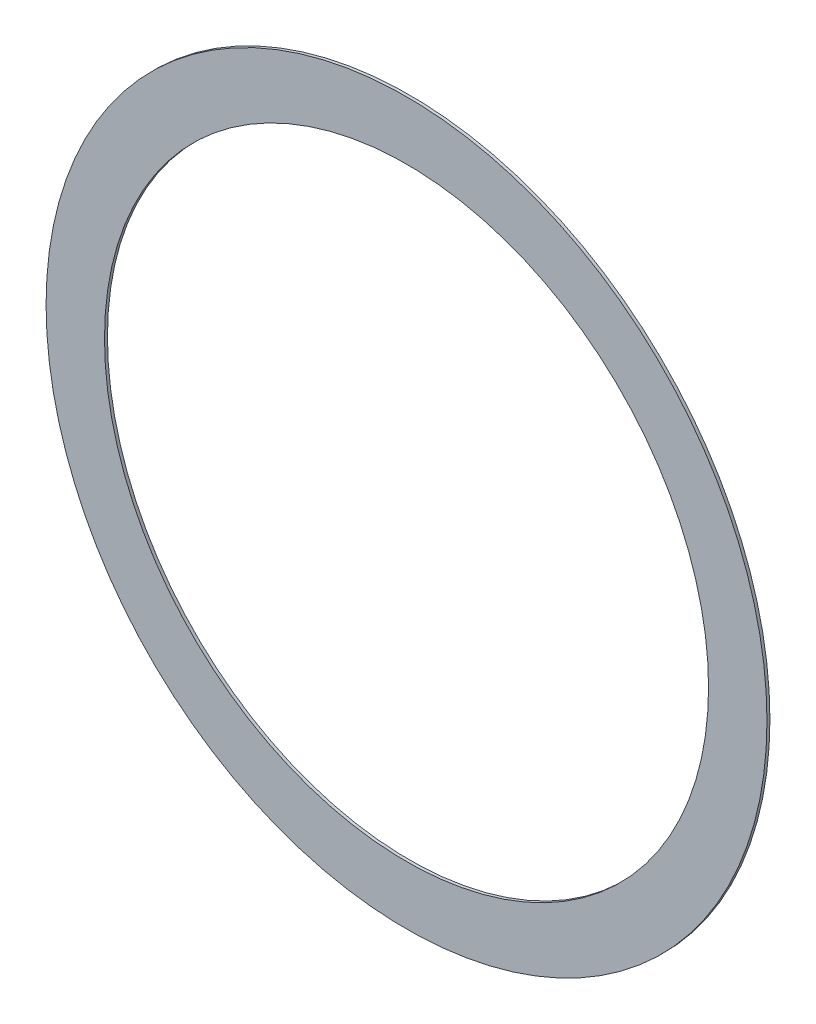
from build123d import *

# Parameters (mm, degrees)
SKETCH_1_R      = 66.95
SKETCH_1_R_2    = 56.1
EXTRUDE_1_DEPTH = 0.55


with BuildPart() as part:
    # Sketch 1 → Extrude 1 (new body)
    with BuildSketch(Plane.XY):
        Circle(SKETCH_1_R)
        Circle(SKETCH_1_R_2, mode=Mode.SUBTRACT)
    extrude(amount=EXTRUDE_1_DEPTH)


solid = part.part
